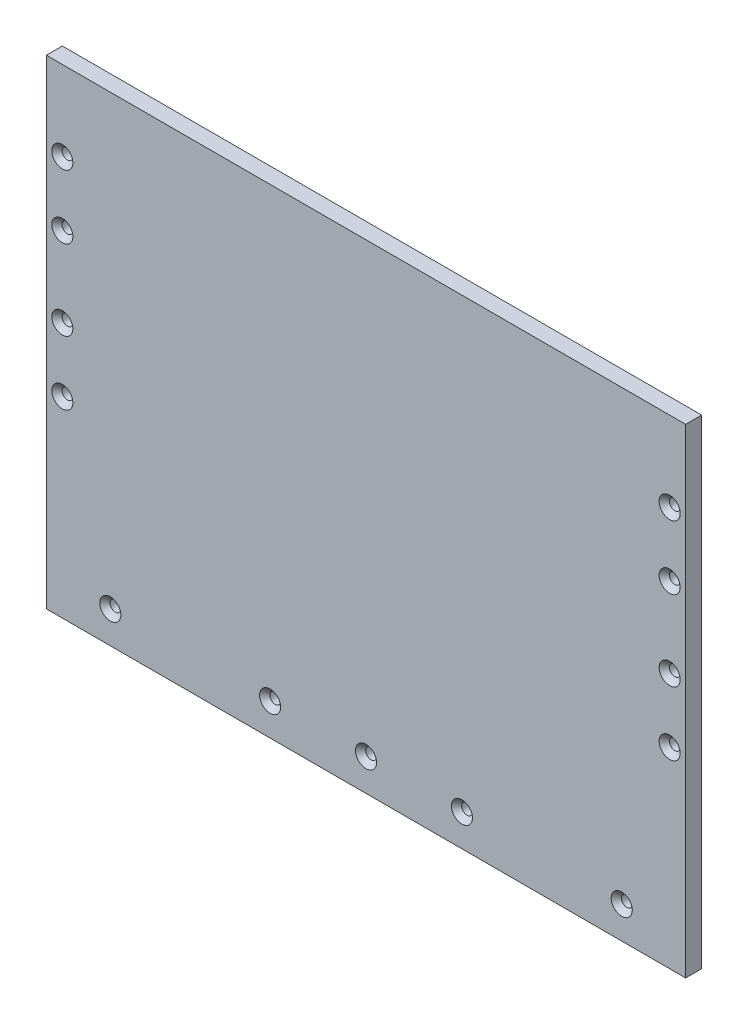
ISO-10303-21;
HEADER;
FILE_DESCRIPTION(('STEP AP214'),'2;1');
FILE_NAME('part.step','',(''),(''),'','','');
FILE_SCHEMA(('AUTOMOTIVE_DESIGN { 1 0 10303 214 1 1 1 1 }'));
ENDSEC;
DATA;
#1=APPLICATION_CONTEXT('core data for automotive mechanical design processes');
#2=APPLICATION_PROTOCOL_DEFINITION('international standard','automotive_design',2000,#1);
#3=PRODUCT_CONTEXT('',#1,'mechanical');
#4=PRODUCT('Part','Part','',(#3));
#5=PRODUCT_RELATED_PRODUCT_CATEGORY('part','',(#4));
#6=PRODUCT_DEFINITION_FORMATION('','',#4);
#7=PRODUCT_DEFINITION_CONTEXT('part definition',#1,'design');
#8=PRODUCT_DEFINITION('design','',#6,#7);
#9=PRODUCT_DEFINITION_SHAPE('','',#8);
#10=(LENGTH_UNIT() NAMED_UNIT(*) SI_UNIT(.MILLI.,.METRE.));
#11=(NAMED_UNIT(*) PLANE_ANGLE_UNIT() SI_UNIT($,.RADIAN.));
#12=(NAMED_UNIT(*) SI_UNIT($,.STERADIAN.) SOLID_ANGLE_UNIT());
#13=UNCERTAINTY_MEASURE_WITH_UNIT(LENGTH_MEASURE(1.E-05),#10,'distance_accuracy_value','');
#14=(GEOMETRIC_REPRESENTATION_CONTEXT(3) GLOBAL_UNCERTAINTY_ASSIGNED_CONTEXT((#13)) GLOBAL_UNIT_ASSIGNED_CONTEXT((#10,
#11,#12)) REPRESENTATION_CONTEXT('',''));
#15=CARTESIAN_POINT('',(0.,0.,0.));
#16=DIRECTION('',(0.,0.,1.));
#17=DIRECTION('',(1.,0.,0.));
#18=AXIS2_PLACEMENT_3D('',#15,#16,#17);
#19=CARTESIAN_POINT('',(100.,75.,5.));
#20=DIRECTION('',(-1.,0.,0.));
#21=DIRECTION('',(0.,-1.,0.));
#22=AXIS2_PLACEMENT_3D('',#19,#20,#21);
#23=PLANE('',#22);
#24=DIRECTION('',(0.,1.,0.));
#25=VECTOR('',#24,1.);
#26=CARTESIAN_POINT('',(100.,75.,0.));
#27=LINE('',#26,#25);
#28=CARTESIAN_POINT('',(100.,-75.,0.));
#29=VERTEX_POINT('',#28);
#30=CARTESIAN_POINT('',(100.,75.,0.));
#31=VERTEX_POINT('',#30);
#32=EDGE_CURVE('E104',#29,#31,#27,.T.);
#33=ORIENTED_EDGE('',*,*,#32,.T.);
#34=DIRECTION('',(0.,0.,-1.));
#35=VECTOR('',#34,1.);
#36=CARTESIAN_POINT('',(100.,75.,5.));
#37=LINE('',#36,#35);
#38=CARTESIAN_POINT('',(100.,75.,5.));
#39=VERTEX_POINT('',#38);
#40=EDGE_CURVE('E11',#39,#31,#37,.T.);
#41=ORIENTED_EDGE('',*,*,#40,.F.);
#42=DIRECTION('',(0.,1.,0.));
#43=VECTOR('',#42,1.);
#44=CARTESIAN_POINT('',(100.,75.,5.));
#45=LINE('',#44,#43);
#46=CARTESIAN_POINT('',(100.,-75.,5.));
#47=VERTEX_POINT('',#46);
#48=EDGE_CURVE('E91',#47,#39,#45,.T.);
#49=ORIENTED_EDGE('',*,*,#48,.F.);
#50=DIRECTION('',(0.,0.,-1.));
#51=VECTOR('',#50,1.);
#52=CARTESIAN_POINT('',(100.,-75.,5.));
#53=LINE('',#52,#51);
#54=EDGE_CURVE('E100',#47,#29,#53,.T.);
#55=ORIENTED_EDGE('',*,*,#54,.T.);
#56=EDGE_LOOP('',(#33,#41,#49,#55));
#57=FACE_BOUND('',#56,.T.);
#58=ADVANCED_FACE('F38',(#57),#23,.F.);
#59=CARTESIAN_POINT('',(-100.,75.,5.));
#60=DIRECTION('',(0.,-1.,0.));
#61=DIRECTION('',(0.,0.,-1.));
#62=AXIS2_PLACEMENT_3D('',#59,#60,#61);
#63=PLANE('',#62);
#64=DIRECTION('',(-1.,0.,0.));
#65=VECTOR('',#64,1.);
#66=CARTESIAN_POINT('',(-100.,75.,0.));
#67=LINE('',#66,#65);
#68=CARTESIAN_POINT('',(-100.,75.,0.));
#69=VERTEX_POINT('',#68);
#70=EDGE_CURVE('E95',#31,#69,#67,.T.);
#71=ORIENTED_EDGE('',*,*,#70,.T.);
#72=DIRECTION('',(0.,0.,-1.));
#73=VECTOR('',#72,1.);
#74=CARTESIAN_POINT('',(-100.,75.,5.));
#75=LINE('',#74,#73);
#76=CARTESIAN_POINT('',(-100.,75.,5.));
#77=VERTEX_POINT('',#76);
#78=EDGE_CURVE('E47',#77,#69,#75,.T.);
#79=ORIENTED_EDGE('',*,*,#78,.F.);
#80=DIRECTION('',(-1.,0.,0.));
#81=VECTOR('',#80,1.);
#82=CARTESIAN_POINT('',(-100.,75.,5.));
#83=LINE('',#82,#81);
#84=EDGE_CURVE('E86',#39,#77,#83,.T.);
#85=ORIENTED_EDGE('',*,*,#84,.F.);
#86=ORIENTED_EDGE('',*,*,#40,.T.);
#87=EDGE_LOOP('',(#71,#79,#85,#86));
#88=FACE_BOUND('',#87,.T.);
#89=ADVANCED_FACE('F94',(#88),#63,.F.);
#90=CARTESIAN_POINT('',(-100.,75.,5.));
#91=DIRECTION('',(1.,0.,0.));
#92=DIRECTION('',(0.,1.,0.));
#93=AXIS2_PLACEMENT_3D('',#90,#91,#92);
#94=PLANE('',#93);
#95=DIRECTION('',(0.,-1.,0.));
#96=VECTOR('',#95,1.);
#97=CARTESIAN_POINT('',(-100.,75.,0.));
#98=LINE('',#97,#96);
#99=CARTESIAN_POINT('',(-100.,-75.,0.));
#100=VERTEX_POINT('',#99);
#101=EDGE_CURVE('E73',#69,#100,#98,.T.);
#102=ORIENTED_EDGE('',*,*,#101,.T.);
#103=DIRECTION('',(0.,0.,-1.));
#104=VECTOR('',#103,1.);
#105=CARTESIAN_POINT('',(-100.,-75.,5.));
#106=LINE('',#105,#104);
#107=CARTESIAN_POINT('',(-100.,-75.,5.));
#108=VERTEX_POINT('',#107);
#109=EDGE_CURVE('E96',#108,#100,#106,.T.);
#110=ORIENTED_EDGE('',*,*,#109,.F.);
#111=DIRECTION('',(0.,-1.,0.));
#112=VECTOR('',#111,1.);
#113=CARTESIAN_POINT('',(-100.,75.,5.));
#114=LINE('',#113,#112);
#115=EDGE_CURVE('E89',#77,#108,#114,.T.);
#116=ORIENTED_EDGE('',*,*,#115,.F.);
#117=ORIENTED_EDGE('',*,*,#78,.T.);
#118=EDGE_LOOP('',(#102,#110,#116,#117));
#119=FACE_BOUND('',#118,.T.);
#120=ADVANCED_FACE('F98',(#119),#94,.F.);
#121=CARTESIAN_POINT('',(-100.,-75.,5.));
#122=DIRECTION('',(0.,1.,0.));
#123=DIRECTION('',(0.,0.,1.));
#124=AXIS2_PLACEMENT_3D('',#121,#122,#123);
#125=PLANE('',#124);
#126=DIRECTION('',(1.,0.,0.));
#127=VECTOR('',#126,1.);
#128=CARTESIAN_POINT('',(-100.,-75.,0.));
#129=LINE('',#128,#127);
#130=EDGE_CURVE('E79',#100,#29,#129,.T.);
#131=ORIENTED_EDGE('',*,*,#130,.T.);
#132=ORIENTED_EDGE('',*,*,#54,.F.);
#133=DIRECTION('',(1.,0.,0.));
#134=VECTOR('',#133,1.);
#135=CARTESIAN_POINT('',(-100.,-75.,5.));
#136=LINE('',#135,#134);
#137=EDGE_CURVE('E56',#108,#47,#136,.T.);
#138=ORIENTED_EDGE('',*,*,#137,.F.);
#139=ORIENTED_EDGE('',*,*,#109,.T.);
#140=EDGE_LOOP('',(#131,#132,#138,#139));
#141=FACE_BOUND('',#140,.T.);
#142=ADVANCED_FACE('F237',(#141),#125,.F.);
#143=CARTESIAN_POINT('',(0.,0.,5.));
#144=DIRECTION('',(0.,0.,1.));
#145=DIRECTION('',(1.,0.,0.));
#146=AXIS2_PLACEMENT_3D('',#143,#144,#145);
#147=PLANE('',#146);
#148=CARTESIAN_POINT('',(-95.,50.,5.));
#149=DIRECTION('',(0.,0.,1.));
#150=DIRECTION('',(1.,0.,0.));
#151=AXIS2_PLACEMENT_3D('',#148,#149,#150);
#152=CIRCLE('',#151,3.3);
#153=CARTESIAN_POINT('',(-91.7,50.,5.));
#154=VERTEX_POINT('',#153);
#155=EDGE_CURVE('E611',#154,#154,#152,.T.);
#156=ORIENTED_EDGE('',*,*,#155,.F.);
#157=EDGE_LOOP('',(#156));
#158=FACE_BOUND('',#157,.T.);
#159=CARTESIAN_POINT('',(-95.,30.,5.));
#160=DIRECTION('',(0.,0.,1.));
#161=DIRECTION('',(1.,0.,0.));
#162=AXIS2_PLACEMENT_3D('',#159,#160,#161);
#163=CIRCLE('',#162,3.3);
#164=CARTESIAN_POINT('',(-91.7,30.,5.));
#165=VERTEX_POINT('',#164);
#166=EDGE_CURVE('E174',#165,#165,#163,.T.);
#167=ORIENTED_EDGE('',*,*,#166,.F.);
#168=EDGE_LOOP('',(#167));
#169=FACE_BOUND('',#168,.T.);
#170=CARTESIAN_POINT('',(-95.,5.00000000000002,5.));
#171=DIRECTION('',(0.,0.,1.));
#172=DIRECTION('',(1.,0.,0.));
#173=AXIS2_PLACEMENT_3D('',#170,#171,#172);
#174=CIRCLE('',#173,3.3);
#175=CARTESIAN_POINT('',(-91.7,5.00000000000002,5.));
#176=VERTEX_POINT('',#175);
#177=EDGE_CURVE('E167',#176,#176,#174,.T.);
#178=ORIENTED_EDGE('',*,*,#177,.F.);
#179=EDGE_LOOP('',(#178));
#180=FACE_BOUND('',#179,.T.);
#181=CARTESIAN_POINT('',(-95.,-15.,5.));
#182=DIRECTION('',(0.,0.,1.));
#183=DIRECTION('',(1.,0.,0.));
#184=AXIS2_PLACEMENT_3D('',#181,#182,#183);
#185=CIRCLE('',#184,3.3);
#186=CARTESIAN_POINT('',(-91.7,-15.,5.));
#187=VERTEX_POINT('',#186);
#188=EDGE_CURVE('E163',#187,#187,#185,.T.);
#189=ORIENTED_EDGE('',*,*,#188,.F.);
#190=EDGE_LOOP('',(#189));
#191=FACE_BOUND('',#190,.T.);
#192=CARTESIAN_POINT('',(-80.,-65.,5.));
#193=DIRECTION('',(0.,0.,1.));
#194=DIRECTION('',(1.,0.,0.));
#195=AXIS2_PLACEMENT_3D('',#192,#193,#194);
#196=CIRCLE('',#195,3.3);
#197=CARTESIAN_POINT('',(-76.7,-65.,5.));
#198=VERTEX_POINT('',#197);
#199=EDGE_CURVE('E159',#198,#198,#196,.T.);
#200=ORIENTED_EDGE('',*,*,#199,.F.);
#201=EDGE_LOOP('',(#200));
#202=FACE_BOUND('',#201,.T.);
#203=CARTESIAN_POINT('',(95.,50.,5.));
#204=DIRECTION('',(0.,0.,1.));
#205=DIRECTION('',(1.,0.,0.));
#206=AXIS2_PLACEMENT_3D('',#203,#204,#205);
#207=CIRCLE('',#206,3.3);
#208=CARTESIAN_POINT('',(98.3,50.,5.));
#209=VERTEX_POINT('',#208);
#210=EDGE_CURVE('E154',#209,#209,#207,.T.);
#211=ORIENTED_EDGE('',*,*,#210,.F.);
#212=EDGE_LOOP('',(#211));
#213=FACE_BOUND('',#212,.T.);
#214=CARTESIAN_POINT('',(95.,30.,5.));
#215=DIRECTION('',(0.,0.,1.));
#216=DIRECTION('',(1.,0.,0.));
#217=AXIS2_PLACEMENT_3D('',#214,#215,#216);
#218=CIRCLE('',#217,3.3);
#219=CARTESIAN_POINT('',(98.3,30.,5.));
#220=VERTEX_POINT('',#219);
#221=EDGE_CURVE('E149',#220,#220,#218,.T.);
#222=ORIENTED_EDGE('',*,*,#221,.F.);
#223=EDGE_LOOP('',(#222));
#224=FACE_BOUND('',#223,.T.);
#225=CARTESIAN_POINT('',(95.,5.00000000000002,5.));
#226=DIRECTION('',(0.,0.,1.));
#227=DIRECTION('',(1.,0.,0.));
#228=AXIS2_PLACEMENT_3D('',#225,#226,#227);
#229=CIRCLE('',#228,3.3);
#230=CARTESIAN_POINT('',(98.3,5.00000000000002,5.));
#231=VERTEX_POINT('',#230);
#232=EDGE_CURVE('E144',#231,#231,#229,.T.);
#233=ORIENTED_EDGE('',*,*,#232,.F.);
#234=EDGE_LOOP('',(#233));
#235=FACE_BOUND('',#234,.T.);
#236=CARTESIAN_POINT('',(95.,-15.,5.));
#237=DIRECTION('',(0.,0.,1.));
#238=DIRECTION('',(1.,0.,0.));
#239=AXIS2_PLACEMENT_3D('',#236,#237,#238);
#240=CIRCLE('',#239,3.3);
#241=CARTESIAN_POINT('',(98.3,-15.,5.));
#242=VERTEX_POINT('',#241);
#243=EDGE_CURVE('E139',#242,#242,#240,.T.);
#244=ORIENTED_EDGE('',*,*,#243,.F.);
#245=EDGE_LOOP('',(#244));
#246=FACE_BOUND('',#245,.T.);
#247=CARTESIAN_POINT('',(80.,-65.,5.));
#248=DIRECTION('',(0.,0.,1.));
#249=DIRECTION('',(1.,0.,0.));
#250=AXIS2_PLACEMENT_3D('',#247,#248,#249);
#251=CIRCLE('',#250,3.3);
#252=CARTESIAN_POINT('',(83.3,-65.,5.));
#253=VERTEX_POINT('',#252);
#254=EDGE_CURVE('E134',#253,#253,#251,.T.);
#255=ORIENTED_EDGE('',*,*,#254,.F.);
#256=EDGE_LOOP('',(#255));
#257=FACE_BOUND('',#256,.T.);
#258=CARTESIAN_POINT('',(-30.,-65.,5.));
#259=DIRECTION('',(0.,0.,1.));
#260=DIRECTION('',(1.,0.,0.));
#261=AXIS2_PLACEMENT_3D('',#258,#259,#260);
#262=CIRCLE('',#261,3.3);
#263=CARTESIAN_POINT('',(-26.7,-65.,5.));
#264=VERTEX_POINT('',#263);
#265=EDGE_CURVE('E129',#264,#264,#262,.T.);
#266=ORIENTED_EDGE('',*,*,#265,.F.);
#267=EDGE_LOOP('',(#266));
#268=FACE_BOUND('',#267,.T.);
#269=CARTESIAN_POINT('',(0.,-65.,5.));
#270=DIRECTION('',(0.,0.,1.));
#271=DIRECTION('',(1.,0.,0.));
#272=AXIS2_PLACEMENT_3D('',#269,#270,#271);
#273=CIRCLE('',#272,3.3);
#274=CARTESIAN_POINT('',(3.29999999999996,-65.,5.));
#275=VERTEX_POINT('',#274);
#276=EDGE_CURVE('E124',#275,#275,#273,.T.);
#277=ORIENTED_EDGE('',*,*,#276,.F.);
#278=EDGE_LOOP('',(#277));
#279=FACE_BOUND('',#278,.T.);
#280=CARTESIAN_POINT('',(30.,-65.,5.));
#281=DIRECTION('',(0.,0.,1.));
#282=DIRECTION('',(1.,0.,0.));
#283=AXIS2_PLACEMENT_3D('',#280,#281,#282);
#284=CIRCLE('',#283,3.3);
#285=CARTESIAN_POINT('',(33.3,-65.,5.));
#286=VERTEX_POINT('',#285);
#287=EDGE_CURVE('E119',#286,#286,#284,.T.);
#288=ORIENTED_EDGE('',*,*,#287,.F.);
#289=EDGE_LOOP('',(#288));
#290=FACE_BOUND('',#289,.T.);
#291=ORIENTED_EDGE('',*,*,#48,.T.);
#292=ORIENTED_EDGE('',*,*,#84,.T.);
#293=ORIENTED_EDGE('',*,*,#115,.T.);
#294=ORIENTED_EDGE('',*,*,#137,.T.);
#295=EDGE_LOOP('',(#291,#292,#293,#294));
#296=FACE_BOUND('',#295,.T.);
#297=ADVANCED_FACE('F87',(#158,#169,#180,#191,#202,#213,#224,#235,#246,#257,#268,#279,#290,
#296),#147,.T.);
#298=CARTESIAN_POINT('',(0.,0.,0.));
#299=DIRECTION('',(0.,0.,1.));
#300=DIRECTION('',(1.,0.,0.));
#301=AXIS2_PLACEMENT_3D('',#298,#299,#300);
#302=PLANE('',#301);
#303=CARTESIAN_POINT('',(-95.,50.,0.));
#304=DIRECTION('',(0.,0.,1.));
#305=DIRECTION('',(1.,0.,0.));
#306=AXIS2_PLACEMENT_3D('',#303,#304,#305);
#307=CIRCLE('',#306,1.69999999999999);
#308=CARTESIAN_POINT('',(-93.3000000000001,50.,0.));
#309=VERTEX_POINT('',#308);
#310=EDGE_CURVE('E41',#309,#309,#307,.T.);
#311=ORIENTED_EDGE('',*,*,#310,.T.);
#312=EDGE_LOOP('',(#311));
#313=FACE_BOUND('',#312,.T.);
#314=CARTESIAN_POINT('',(-95.,30.,0.));
#315=DIRECTION('',(0.,0.,1.));
#316=DIRECTION('',(1.,0.,0.));
#317=AXIS2_PLACEMENT_3D('',#314,#315,#316);
#318=CIRCLE('',#317,1.69999999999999);
#319=CARTESIAN_POINT('',(-93.3000000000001,30.,0.));
#320=VERTEX_POINT('',#319);
#321=EDGE_CURVE('E165',#320,#320,#318,.T.);
#322=ORIENTED_EDGE('',*,*,#321,.T.);
#323=EDGE_LOOP('',(#322));
#324=FACE_BOUND('',#323,.T.);
#325=CARTESIAN_POINT('',(-95.,5.00000000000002,0.));
#326=DIRECTION('',(0.,0.,1.));
#327=DIRECTION('',(1.,0.,0.));
#328=AXIS2_PLACEMENT_3D('',#325,#326,#327);
#329=CIRCLE('',#328,1.69999999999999);
#330=CARTESIAN_POINT('',(-93.3000000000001,5.00000000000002,0.));
#331=VERTEX_POINT('',#330);
#332=EDGE_CURVE('E161',#331,#331,#329,.T.);
#333=ORIENTED_EDGE('',*,*,#332,.T.);
#334=EDGE_LOOP('',(#333));
#335=FACE_BOUND('',#334,.T.);
#336=CARTESIAN_POINT('',(-95.,-15.,0.));
#337=DIRECTION('',(0.,0.,1.));
#338=DIRECTION('',(1.,0.,0.));
#339=AXIS2_PLACEMENT_3D('',#336,#337,#338);
#340=CIRCLE('',#339,1.69999999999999);
#341=CARTESIAN_POINT('',(-93.3000000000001,-15.,0.));
#342=VERTEX_POINT('',#341);
#343=EDGE_CURVE('E156',#342,#342,#340,.T.);
#344=ORIENTED_EDGE('',*,*,#343,.T.);
#345=EDGE_LOOP('',(#344));
#346=FACE_BOUND('',#345,.T.);
#347=CARTESIAN_POINT('',(-80.,-65.,0.));
#348=DIRECTION('',(0.,0.,1.));
#349=DIRECTION('',(1.,0.,0.));
#350=AXIS2_PLACEMENT_3D('',#347,#348,#349);
#351=CIRCLE('',#350,1.69999999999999);
#352=CARTESIAN_POINT('',(-78.3000000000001,-65.,0.));
#353=VERTEX_POINT('',#352);
#354=EDGE_CURVE('E151',#353,#353,#351,.T.);
#355=ORIENTED_EDGE('',*,*,#354,.T.);
#356=EDGE_LOOP('',(#355));
#357=FACE_BOUND('',#356,.T.);
#358=CARTESIAN_POINT('',(95.,50.,0.));
#359=DIRECTION('',(0.,0.,1.));
#360=DIRECTION('',(1.,0.,0.));
#361=AXIS2_PLACEMENT_3D('',#358,#359,#360);
#362=CIRCLE('',#361,1.69999999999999);
#363=CARTESIAN_POINT('',(96.7,50.,0.));
#364=VERTEX_POINT('',#363);
#365=EDGE_CURVE('E146',#364,#364,#362,.T.);
#366=ORIENTED_EDGE('',*,*,#365,.T.);
#367=EDGE_LOOP('',(#366));
#368=FACE_BOUND('',#367,.T.);
#369=CARTESIAN_POINT('',(95.,30.,0.));
#370=DIRECTION('',(0.,0.,1.));
#371=DIRECTION('',(1.,0.,0.));
#372=AXIS2_PLACEMENT_3D('',#369,#370,#371);
#373=CIRCLE('',#372,1.69999999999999);
#374=CARTESIAN_POINT('',(96.7,30.,0.));
#375=VERTEX_POINT('',#374);
#376=EDGE_CURVE('E141',#375,#375,#373,.T.);
#377=ORIENTED_EDGE('',*,*,#376,.T.);
#378=EDGE_LOOP('',(#377));
#379=FACE_BOUND('',#378,.T.);
#380=CARTESIAN_POINT('',(95.,5.00000000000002,0.));
#381=DIRECTION('',(0.,0.,1.));
#382=DIRECTION('',(1.,0.,0.));
#383=AXIS2_PLACEMENT_3D('',#380,#381,#382);
#384=CIRCLE('',#383,1.69999999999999);
#385=CARTESIAN_POINT('',(96.7,5.00000000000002,0.));
#386=VERTEX_POINT('',#385);
#387=EDGE_CURVE('E136',#386,#386,#384,.T.);
#388=ORIENTED_EDGE('',*,*,#387,.T.);
#389=EDGE_LOOP('',(#388));
#390=FACE_BOUND('',#389,.T.);
#391=CARTESIAN_POINT('',(95.,-15.,0.));
#392=DIRECTION('',(0.,0.,1.));
#393=DIRECTION('',(1.,0.,0.));
#394=AXIS2_PLACEMENT_3D('',#391,#392,#393);
#395=CIRCLE('',#394,1.69999999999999);
#396=CARTESIAN_POINT('',(96.7,-15.,0.));
#397=VERTEX_POINT('',#396);
#398=EDGE_CURVE('E131',#397,#397,#395,.T.);
#399=ORIENTED_EDGE('',*,*,#398,.T.);
#400=EDGE_LOOP('',(#399));
#401=FACE_BOUND('',#400,.T.);
#402=CARTESIAN_POINT('',(80.,-65.,0.));
#403=DIRECTION('',(0.,0.,1.));
#404=DIRECTION('',(1.,0.,0.));
#405=AXIS2_PLACEMENT_3D('',#402,#403,#404);
#406=CIRCLE('',#405,1.69999999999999);
#407=CARTESIAN_POINT('',(81.7,-65.,0.));
#408=VERTEX_POINT('',#407);
#409=EDGE_CURVE('E126',#408,#408,#406,.T.);
#410=ORIENTED_EDGE('',*,*,#409,.T.);
#411=EDGE_LOOP('',(#410));
#412=FACE_BOUND('',#411,.T.);
#413=CARTESIAN_POINT('',(-30.,-65.,0.));
#414=DIRECTION('',(0.,0.,1.));
#415=DIRECTION('',(1.,0.,0.));
#416=AXIS2_PLACEMENT_3D('',#413,#414,#415);
#417=CIRCLE('',#416,1.69999999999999);
#418=CARTESIAN_POINT('',(-28.3000000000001,-65.,0.));
#419=VERTEX_POINT('',#418);
#420=EDGE_CURVE('E121',#419,#419,#417,.T.);
#421=ORIENTED_EDGE('',*,*,#420,.T.);
#422=EDGE_LOOP('',(#421));
#423=FACE_BOUND('',#422,.T.);
#424=CARTESIAN_POINT('',(0.,-65.,0.));
#425=DIRECTION('',(0.,0.,1.));
#426=DIRECTION('',(1.,0.,0.));
#427=AXIS2_PLACEMENT_3D('',#424,#425,#426);
#428=CIRCLE('',#427,1.69999999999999);
#429=CARTESIAN_POINT('',(1.69999999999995,-65.,0.));
#430=VERTEX_POINT('',#429);
#431=EDGE_CURVE('E116',#430,#430,#428,.T.);
#432=ORIENTED_EDGE('',*,*,#431,.T.);
#433=EDGE_LOOP('',(#432));
#434=FACE_BOUND('',#433,.T.);
#435=CARTESIAN_POINT('',(30.,-65.,0.));
#436=DIRECTION('',(0.,0.,1.));
#437=DIRECTION('',(1.,0.,0.));
#438=AXIS2_PLACEMENT_3D('',#435,#436,#437);
#439=CIRCLE('',#438,1.69999999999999);
#440=CARTESIAN_POINT('',(31.6999999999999,-65.,0.));
#441=VERTEX_POINT('',#440);
#442=EDGE_CURVE('E107',#441,#441,#439,.T.);
#443=ORIENTED_EDGE('',*,*,#442,.T.);
#444=EDGE_LOOP('',(#443));
#445=FACE_BOUND('',#444,.T.);
#446=ORIENTED_EDGE('',*,*,#32,.F.);
#447=ORIENTED_EDGE('',*,*,#130,.F.);
#448=ORIENTED_EDGE('',*,*,#101,.F.);
#449=ORIENTED_EDGE('',*,*,#70,.F.);
#450=EDGE_LOOP('',(#446,#447,#448,#449));
#451=FACE_BOUND('',#450,.T.);
#452=ADVANCED_FACE('F236',(#313,#324,#335,#346,#357,#368,#379,#390,#401,#412,#423,#434,#445,
#451),#302,.F.);
#453=CARTESIAN_POINT('',(30.,-65.,5.));
#454=DIRECTION('',(0.,0.,1.));
#455=DIRECTION('',(1.,0.,0.));
#456=AXIS2_PLACEMENT_3D('',#453,#454,#455);
#457=CYLINDRICAL_SURFACE('',#456,1.69999999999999);
#458=CARTESIAN_POINT('',(30.,-65.,3.39999999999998));
#459=DIRECTION('',(0.,0.,1.));
#460=DIRECTION('',(1.,0.,0.));
#461=AXIS2_PLACEMENT_3D('',#458,#459,#460);
#462=CIRCLE('',#461,1.69999999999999);
#463=CARTESIAN_POINT('',(31.6999999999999,-65.,3.39999999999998));
#464=VERTEX_POINT('',#463);
#465=EDGE_CURVE('E115',#464,#464,#462,.T.);
#466=ORIENTED_EDGE('',*,*,#465,.T.);
#467=EDGE_LOOP('',(#466));
#468=FACE_BOUND('',#467,.T.);
#469=ORIENTED_EDGE('',*,*,#442,.F.);
#470=EDGE_LOOP('',(#469));
#471=FACE_BOUND('',#470,.T.);
#472=ADVANCED_FACE('F225',(#468,#471),#457,.F.);
#473=CARTESIAN_POINT('',(30.,-65.,5.));
#474=DIRECTION('',(0.,0.,1.));
#475=DIRECTION('',(1.,0.,0.));
#476=AXIS2_PLACEMENT_3D('',#473,#474,#475);
#477=CONICAL_SURFACE('',#476,3.3,0.785398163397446);
#478=ORIENTED_EDGE('',*,*,#465,.F.);
#479=EDGE_LOOP('',(#478));
#480=FACE_BOUND('',#479,.T.);
#481=ORIENTED_EDGE('',*,*,#287,.T.);
#482=EDGE_LOOP('',(#481));
#483=FACE_BOUND('',#482,.T.);
#484=ADVANCED_FACE('F228',(#480,#483),#477,.F.);
#485=CARTESIAN_POINT('',(0.,-65.,5.));
#486=DIRECTION('',(0.,0.,1.));
#487=DIRECTION('',(1.,0.,0.));
#488=AXIS2_PLACEMENT_3D('',#485,#486,#487);
#489=CYLINDRICAL_SURFACE('',#488,1.69999999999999);
#490=CARTESIAN_POINT('',(0.,-65.,3.39999999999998));
#491=DIRECTION('',(0.,0.,1.));
#492=DIRECTION('',(1.,0.,0.));
#493=AXIS2_PLACEMENT_3D('',#490,#491,#492);
#494=CIRCLE('',#493,1.69999999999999);
#495=CARTESIAN_POINT('',(1.69999999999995,-65.,3.39999999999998));
#496=VERTEX_POINT('',#495);
#497=EDGE_CURVE('E120',#496,#496,#494,.T.);
#498=ORIENTED_EDGE('',*,*,#497,.T.);
#499=EDGE_LOOP('',(#498));
#500=FACE_BOUND('',#499,.T.);
#501=ORIENTED_EDGE('',*,*,#431,.F.);
#502=EDGE_LOOP('',(#501));
#503=FACE_BOUND('',#502,.T.);
#504=ADVANCED_FACE('F231',(#500,#503),#489,.F.);
#505=CARTESIAN_POINT('',(0.,-65.,5.));
#506=DIRECTION('',(0.,0.,1.));
#507=DIRECTION('',(1.,0.,0.));
#508=AXIS2_PLACEMENT_3D('',#505,#506,#507);
#509=CONICAL_SURFACE('',#508,3.3,0.785398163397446);
#510=ORIENTED_EDGE('',*,*,#497,.F.);
#511=EDGE_LOOP('',(#510));
#512=FACE_BOUND('',#511,.T.);
#513=ORIENTED_EDGE('',*,*,#276,.T.);
#514=EDGE_LOOP('',(#513));
#515=FACE_BOUND('',#514,.T.);
#516=ADVANCED_FACE('F304',(#512,#515),#509,.F.);
#517=CARTESIAN_POINT('',(-30.,-65.,5.));
#518=DIRECTION('',(0.,0.,1.));
#519=DIRECTION('',(1.,0.,0.));
#520=AXIS2_PLACEMENT_3D('',#517,#518,#519);
#521=CYLINDRICAL_SURFACE('',#520,1.69999999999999);
#522=CARTESIAN_POINT('',(-30.,-65.,3.39999999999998));
#523=DIRECTION('',(0.,0.,1.));
#524=DIRECTION('',(1.,0.,0.));
#525=AXIS2_PLACEMENT_3D('',#522,#523,#524);
#526=CIRCLE('',#525,1.69999999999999);
#527=CARTESIAN_POINT('',(-28.3000000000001,-65.,3.39999999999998));
#528=VERTEX_POINT('',#527);
#529=EDGE_CURVE('E125',#528,#528,#526,.T.);
#530=ORIENTED_EDGE('',*,*,#529,.T.);
#531=EDGE_LOOP('',(#530));
#532=FACE_BOUND('',#531,.T.);
#533=ORIENTED_EDGE('',*,*,#420,.F.);
#534=EDGE_LOOP('',(#533));
#535=FACE_BOUND('',#534,.T.);
#536=ADVANCED_FACE('F315',(#532,#535),#521,.F.);
#537=CARTESIAN_POINT('',(-30.,-65.,5.));
#538=DIRECTION('',(0.,0.,1.));
#539=DIRECTION('',(1.,0.,0.));
#540=AXIS2_PLACEMENT_3D('',#537,#538,#539);
#541=CONICAL_SURFACE('',#540,3.3,0.785398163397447);
#542=ORIENTED_EDGE('',*,*,#529,.F.);
#543=EDGE_LOOP('',(#542));
#544=FACE_BOUND('',#543,.T.);
#545=ORIENTED_EDGE('',*,*,#265,.T.);
#546=EDGE_LOOP('',(#545));
#547=FACE_BOUND('',#546,.T.);
#548=ADVANCED_FACE('F326',(#544,#547),#541,.F.);
#549=CARTESIAN_POINT('',(80.,-65.,5.));
#550=DIRECTION('',(0.,0.,1.));
#551=DIRECTION('',(1.,0.,0.));
#552=AXIS2_PLACEMENT_3D('',#549,#550,#551);
#553=CYLINDRICAL_SURFACE('',#552,1.69999999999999);
#554=CARTESIAN_POINT('',(80.,-65.,3.39999999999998));
#555=DIRECTION('',(0.,0.,1.));
#556=DIRECTION('',(1.,0.,0.));
#557=AXIS2_PLACEMENT_3D('',#554,#555,#556);
#558=CIRCLE('',#557,1.69999999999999);
#559=CARTESIAN_POINT('',(81.7,-65.,3.39999999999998));
#560=VERTEX_POINT('',#559);
#561=EDGE_CURVE('E130',#560,#560,#558,.T.);
#562=ORIENTED_EDGE('',*,*,#561,.T.);
#563=EDGE_LOOP('',(#562));
#564=FACE_BOUND('',#563,.T.);
#565=ORIENTED_EDGE('',*,*,#409,.F.);
#566=EDGE_LOOP('',(#565));
#567=FACE_BOUND('',#566,.T.);
#568=ADVANCED_FACE('F337',(#564,#567),#553,.F.);
#569=CARTESIAN_POINT('',(80.,-65.,5.));
#570=DIRECTION('',(0.,0.,1.));
#571=DIRECTION('',(1.,0.,0.));
#572=AXIS2_PLACEMENT_3D('',#569,#570,#571);
#573=CONICAL_SURFACE('',#572,3.3,0.785398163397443);
#574=ORIENTED_EDGE('',*,*,#561,.F.);
#575=EDGE_LOOP('',(#574));
#576=FACE_BOUND('',#575,.T.);
#577=ORIENTED_EDGE('',*,*,#254,.T.);
#578=EDGE_LOOP('',(#577));
#579=FACE_BOUND('',#578,.T.);
#580=ADVANCED_FACE('F348',(#576,#579),#573,.F.);
#581=CARTESIAN_POINT('',(95.,-15.,5.));
#582=DIRECTION('',(0.,0.,1.));
#583=DIRECTION('',(1.,0.,0.));
#584=AXIS2_PLACEMENT_3D('',#581,#582,#583);
#585=CYLINDRICAL_SURFACE('',#584,1.69999999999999);
#586=CARTESIAN_POINT('',(95.,-15.,3.39999999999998));
#587=DIRECTION('',(0.,0.,1.));
#588=DIRECTION('',(1.,0.,0.));
#589=AXIS2_PLACEMENT_3D('',#586,#587,#588);
#590=CIRCLE('',#589,1.69999999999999);
#591=CARTESIAN_POINT('',(96.7,-15.,3.39999999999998));
#592=VERTEX_POINT('',#591);
#593=EDGE_CURVE('E135',#592,#592,#590,.T.);
#594=ORIENTED_EDGE('',*,*,#593,.T.);
#595=EDGE_LOOP('',(#594));
#596=FACE_BOUND('',#595,.T.);
#597=ORIENTED_EDGE('',*,*,#398,.F.);
#598=EDGE_LOOP('',(#597));
#599=FACE_BOUND('',#598,.T.);
#600=ADVANCED_FACE('F359',(#596,#599),#585,.F.);
#601=CARTESIAN_POINT('',(95.,-15.,5.));
#602=DIRECTION('',(0.,0.,1.));
#603=DIRECTION('',(1.,0.,0.));
#604=AXIS2_PLACEMENT_3D('',#601,#602,#603);
#605=CONICAL_SURFACE('',#604,3.3,0.785398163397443);
#606=ORIENTED_EDGE('',*,*,#593,.F.);
#607=EDGE_LOOP('',(#606));
#608=FACE_BOUND('',#607,.T.);
#609=ORIENTED_EDGE('',*,*,#243,.T.);
#610=EDGE_LOOP('',(#609));
#611=FACE_BOUND('',#610,.T.);
#612=ADVANCED_FACE('F370',(#608,#611),#605,.F.);
#613=CARTESIAN_POINT('',(95.,5.00000000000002,5.));
#614=DIRECTION('',(0.,0.,1.));
#615=DIRECTION('',(1.,0.,0.));
#616=AXIS2_PLACEMENT_3D('',#613,#614,#615);
#617=CYLINDRICAL_SURFACE('',#616,1.69999999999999);
#618=CARTESIAN_POINT('',(95.,5.00000000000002,3.39999999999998));
#619=DIRECTION('',(0.,0.,1.));
#620=DIRECTION('',(1.,0.,0.));
#621=AXIS2_PLACEMENT_3D('',#618,#619,#620);
#622=CIRCLE('',#621,1.69999999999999);
#623=CARTESIAN_POINT('',(96.7,5.00000000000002,3.39999999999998));
#624=VERTEX_POINT('',#623);
#625=EDGE_CURVE('E140',#624,#624,#622,.T.);
#626=ORIENTED_EDGE('',*,*,#625,.T.);
#627=EDGE_LOOP('',(#626));
#628=FACE_BOUND('',#627,.T.);
#629=ORIENTED_EDGE('',*,*,#387,.F.);
#630=EDGE_LOOP('',(#629));
#631=FACE_BOUND('',#630,.T.);
#632=ADVANCED_FACE('F381',(#628,#631),#617,.F.);
#633=CARTESIAN_POINT('',(95.,5.00000000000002,5.));
#634=DIRECTION('',(0.,0.,1.));
#635=DIRECTION('',(1.,0.,0.));
#636=AXIS2_PLACEMENT_3D('',#633,#634,#635);
#637=CONICAL_SURFACE('',#636,3.3,0.785398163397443);
#638=ORIENTED_EDGE('',*,*,#625,.F.);
#639=EDGE_LOOP('',(#638));
#640=FACE_BOUND('',#639,.T.);
#641=ORIENTED_EDGE('',*,*,#232,.T.);
#642=EDGE_LOOP('',(#641));
#643=FACE_BOUND('',#642,.T.);
#644=ADVANCED_FACE('F392',(#640,#643),#637,.F.);
#645=CARTESIAN_POINT('',(95.,30.,5.));
#646=DIRECTION('',(0.,0.,1.));
#647=DIRECTION('',(1.,0.,0.));
#648=AXIS2_PLACEMENT_3D('',#645,#646,#647);
#649=CYLINDRICAL_SURFACE('',#648,1.69999999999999);
#650=CARTESIAN_POINT('',(95.,30.,3.39999999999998));
#651=DIRECTION('',(0.,0.,1.));
#652=DIRECTION('',(1.,0.,0.));
#653=AXIS2_PLACEMENT_3D('',#650,#651,#652);
#654=CIRCLE('',#653,1.69999999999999);
#655=CARTESIAN_POINT('',(96.7,30.,3.39999999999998));
#656=VERTEX_POINT('',#655);
#657=EDGE_CURVE('E145',#656,#656,#654,.T.);
#658=ORIENTED_EDGE('',*,*,#657,.T.);
#659=EDGE_LOOP('',(#658));
#660=FACE_BOUND('',#659,.T.);
#661=ORIENTED_EDGE('',*,*,#376,.F.);
#662=EDGE_LOOP('',(#661));
#663=FACE_BOUND('',#662,.T.);
#664=ADVANCED_FACE('F403',(#660,#663),#649,.F.);
#665=CARTESIAN_POINT('',(95.,30.,5.));
#666=DIRECTION('',(0.,0.,1.));
#667=DIRECTION('',(1.,0.,0.));
#668=AXIS2_PLACEMENT_3D('',#665,#666,#667);
#669=CONICAL_SURFACE('',#668,3.3,0.785398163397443);
#670=ORIENTED_EDGE('',*,*,#657,.F.);
#671=EDGE_LOOP('',(#670));
#672=FACE_BOUND('',#671,.T.);
#673=ORIENTED_EDGE('',*,*,#221,.T.);
#674=EDGE_LOOP('',(#673));
#675=FACE_BOUND('',#674,.T.);
#676=ADVANCED_FACE('F414',(#672,#675),#669,.F.);
#677=CARTESIAN_POINT('',(95.,50.,5.));
#678=DIRECTION('',(0.,0.,1.));
#679=DIRECTION('',(1.,0.,0.));
#680=AXIS2_PLACEMENT_3D('',#677,#678,#679);
#681=CYLINDRICAL_SURFACE('',#680,1.69999999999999);
#682=CARTESIAN_POINT('',(95.,50.,3.39999999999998));
#683=DIRECTION('',(0.,0.,1.));
#684=DIRECTION('',(1.,0.,0.));
#685=AXIS2_PLACEMENT_3D('',#682,#683,#684);
#686=CIRCLE('',#685,1.69999999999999);
#687=CARTESIAN_POINT('',(96.7,50.,3.39999999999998));
#688=VERTEX_POINT('',#687);
#689=EDGE_CURVE('E150',#688,#688,#686,.T.);
#690=ORIENTED_EDGE('',*,*,#689,.T.);
#691=EDGE_LOOP('',(#690));
#692=FACE_BOUND('',#691,.T.);
#693=ORIENTED_EDGE('',*,*,#365,.F.);
#694=EDGE_LOOP('',(#693));
#695=FACE_BOUND('',#694,.T.);
#696=ADVANCED_FACE('F425',(#692,#695),#681,.F.);
#697=CARTESIAN_POINT('',(95.,50.,5.));
#698=DIRECTION('',(0.,0.,1.));
#699=DIRECTION('',(1.,0.,0.));
#700=AXIS2_PLACEMENT_3D('',#697,#698,#699);
#701=CONICAL_SURFACE('',#700,3.3,0.785398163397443);
#702=ORIENTED_EDGE('',*,*,#689,.F.);
#703=EDGE_LOOP('',(#702));
#704=FACE_BOUND('',#703,.T.);
#705=ORIENTED_EDGE('',*,*,#210,.T.);
#706=EDGE_LOOP('',(#705));
#707=FACE_BOUND('',#706,.T.);
#708=ADVANCED_FACE('F436',(#704,#707),#701,.F.);
#709=CARTESIAN_POINT('',(-80.,-65.,5.));
#710=DIRECTION('',(0.,0.,1.));
#711=DIRECTION('',(1.,0.,0.));
#712=AXIS2_PLACEMENT_3D('',#709,#710,#711);
#713=CYLINDRICAL_SURFACE('',#712,1.69999999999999);
#714=CARTESIAN_POINT('',(-80.,-65.,3.39999999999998));
#715=DIRECTION('',(0.,0.,1.));
#716=DIRECTION('',(1.,0.,0.));
#717=AXIS2_PLACEMENT_3D('',#714,#715,#716);
#718=CIRCLE('',#717,1.69999999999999);
#719=CARTESIAN_POINT('',(-78.3000000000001,-65.,3.39999999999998));
#720=VERTEX_POINT('',#719);
#721=EDGE_CURVE('E155',#720,#720,#718,.T.);
#722=ORIENTED_EDGE('',*,*,#721,.T.);
#723=EDGE_LOOP('',(#722));
#724=FACE_BOUND('',#723,.T.);
#725=ORIENTED_EDGE('',*,*,#354,.F.);
#726=EDGE_LOOP('',(#725));
#727=FACE_BOUND('',#726,.T.);
#728=ADVANCED_FACE('F447',(#724,#727),#713,.F.);
#729=CARTESIAN_POINT('',(-80.,-65.,5.));
#730=DIRECTION('',(0.,0.,1.));
#731=DIRECTION('',(1.,0.,0.));
#732=AXIS2_PLACEMENT_3D('',#729,#730,#731);
#733=CONICAL_SURFACE('',#732,3.3,0.785398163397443);
#734=ORIENTED_EDGE('',*,*,#721,.F.);
#735=EDGE_LOOP('',(#734));
#736=FACE_BOUND('',#735,.T.);
#737=ORIENTED_EDGE('',*,*,#199,.T.);
#738=EDGE_LOOP('',(#737));
#739=FACE_BOUND('',#738,.T.);
#740=ADVANCED_FACE('F458',(#736,#739),#733,.F.);
#741=CARTESIAN_POINT('',(-95.,-15.,5.));
#742=DIRECTION('',(0.,0.,1.));
#743=DIRECTION('',(1.,0.,0.));
#744=AXIS2_PLACEMENT_3D('',#741,#742,#743);
#745=CYLINDRICAL_SURFACE('',#744,1.69999999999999);
#746=CARTESIAN_POINT('',(-95.,-15.,3.39999999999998));
#747=DIRECTION('',(0.,0.,1.));
#748=DIRECTION('',(1.,0.,0.));
#749=AXIS2_PLACEMENT_3D('',#746,#747,#748);
#750=CIRCLE('',#749,1.69999999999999);
#751=CARTESIAN_POINT('',(-93.3000000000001,-15.,3.39999999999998));
#752=VERTEX_POINT('',#751);
#753=EDGE_CURVE('E160',#752,#752,#750,.T.);
#754=ORIENTED_EDGE('',*,*,#753,.T.);
#755=EDGE_LOOP('',(#754));
#756=FACE_BOUND('',#755,.T.);
#757=ORIENTED_EDGE('',*,*,#343,.F.);
#758=EDGE_LOOP('',(#757));
#759=FACE_BOUND('',#758,.T.);
#760=ADVANCED_FACE('F469',(#756,#759),#745,.F.);
#761=CARTESIAN_POINT('',(-95.,-15.,5.));
#762=DIRECTION('',(0.,0.,1.));
#763=DIRECTION('',(1.,0.,0.));
#764=AXIS2_PLACEMENT_3D('',#761,#762,#763);
#765=CONICAL_SURFACE('',#764,3.3,0.785398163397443);
#766=ORIENTED_EDGE('',*,*,#753,.F.);
#767=EDGE_LOOP('',(#766));
#768=FACE_BOUND('',#767,.T.);
#769=ORIENTED_EDGE('',*,*,#188,.T.);
#770=EDGE_LOOP('',(#769));
#771=FACE_BOUND('',#770,.T.);
#772=ADVANCED_FACE('F480',(#768,#771),#765,.F.);
#773=CARTESIAN_POINT('',(-95.,5.00000000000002,5.));
#774=DIRECTION('',(0.,0.,1.));
#775=DIRECTION('',(1.,0.,0.));
#776=AXIS2_PLACEMENT_3D('',#773,#774,#775);
#777=CYLINDRICAL_SURFACE('',#776,1.69999999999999);
#778=CARTESIAN_POINT('',(-95.,5.00000000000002,3.39999999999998));
#779=DIRECTION('',(0.,0.,1.));
#780=DIRECTION('',(1.,0.,0.));
#781=AXIS2_PLACEMENT_3D('',#778,#779,#780);
#782=CIRCLE('',#781,1.69999999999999);
#783=CARTESIAN_POINT('',(-93.3000000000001,5.00000000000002,3.39999999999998));
#784=VERTEX_POINT('',#783);
#785=EDGE_CURVE('E164',#784,#784,#782,.T.);
#786=ORIENTED_EDGE('',*,*,#785,.T.);
#787=EDGE_LOOP('',(#786));
#788=FACE_BOUND('',#787,.T.);
#789=ORIENTED_EDGE('',*,*,#332,.F.);
#790=EDGE_LOOP('',(#789));
#791=FACE_BOUND('',#790,.T.);
#792=ADVANCED_FACE('F491',(#788,#791),#777,.F.);
#793=CARTESIAN_POINT('',(-95.,5.00000000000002,5.));
#794=DIRECTION('',(0.,0.,1.));
#795=DIRECTION('',(1.,0.,0.));
#796=AXIS2_PLACEMENT_3D('',#793,#794,#795);
#797=CONICAL_SURFACE('',#796,3.3,0.785398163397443);
#798=ORIENTED_EDGE('',*,*,#785,.F.);
#799=EDGE_LOOP('',(#798));
#800=FACE_BOUND('',#799,.T.);
#801=ORIENTED_EDGE('',*,*,#177,.T.);
#802=EDGE_LOOP('',(#801));
#803=FACE_BOUND('',#802,.T.);
#804=ADVANCED_FACE('F502',(#800,#803),#797,.F.);
#805=CARTESIAN_POINT('',(-95.,30.,5.));
#806=DIRECTION('',(0.,0.,1.));
#807=DIRECTION('',(1.,0.,0.));
#808=AXIS2_PLACEMENT_3D('',#805,#806,#807);
#809=CYLINDRICAL_SURFACE('',#808,1.69999999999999);
#810=CARTESIAN_POINT('',(-95.,30.,3.39999999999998));
#811=DIRECTION('',(0.,0.,1.));
#812=DIRECTION('',(1.,0.,0.));
#813=AXIS2_PLACEMENT_3D('',#810,#811,#812);
#814=CIRCLE('',#813,1.69999999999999);
#815=CARTESIAN_POINT('',(-93.3000000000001,30.,3.39999999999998));
#816=VERTEX_POINT('',#815);
#817=EDGE_CURVE('E168',#816,#816,#814,.T.);
#818=ORIENTED_EDGE('',*,*,#817,.T.);
#819=EDGE_LOOP('',(#818));
#820=FACE_BOUND('',#819,.T.);
#821=ORIENTED_EDGE('',*,*,#321,.F.);
#822=EDGE_LOOP('',(#821));
#823=FACE_BOUND('',#822,.T.);
#824=ADVANCED_FACE('F513',(#820,#823),#809,.F.);
#825=CARTESIAN_POINT('',(-95.,30.,5.));
#826=DIRECTION('',(0.,0.,1.));
#827=DIRECTION('',(1.,0.,0.));
#828=AXIS2_PLACEMENT_3D('',#825,#826,#827);
#829=CONICAL_SURFACE('',#828,3.3,0.785398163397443);
#830=ORIENTED_EDGE('',*,*,#817,.F.);
#831=EDGE_LOOP('',(#830));
#832=FACE_BOUND('',#831,.T.);
#833=ORIENTED_EDGE('',*,*,#166,.T.);
#834=EDGE_LOOP('',(#833));
#835=FACE_BOUND('',#834,.T.);
#836=ADVANCED_FACE('F524',(#832,#835),#829,.F.);
#837=CARTESIAN_POINT('',(-95.,50.,5.));
#838=DIRECTION('',(0.,0.,1.));
#839=DIRECTION('',(1.,0.,0.));
#840=AXIS2_PLACEMENT_3D('',#837,#838,#839);
#841=CYLINDRICAL_SURFACE('',#840,1.69999999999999);
#842=CARTESIAN_POINT('',(-95.,50.,3.39999999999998));
#843=DIRECTION('',(0.,0.,1.));
#844=DIRECTION('',(1.,0.,0.));
#845=AXIS2_PLACEMENT_3D('',#842,#843,#844);
#846=CIRCLE('',#845,1.69999999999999);
#847=CARTESIAN_POINT('',(-93.3000000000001,50.,3.39999999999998));
#848=VERTEX_POINT('',#847);
#849=EDGE_CURVE('E609',#848,#848,#846,.T.);
#850=ORIENTED_EDGE('',*,*,#849,.T.);
#851=EDGE_LOOP('',(#850));
#852=FACE_BOUND('',#851,.T.);
#853=ORIENTED_EDGE('',*,*,#310,.F.);
#854=EDGE_LOOP('',(#853));
#855=FACE_BOUND('',#854,.T.);
#856=ADVANCED_FACE('F534',(#852,#855),#841,.F.);
#857=CARTESIAN_POINT('',(-95.,50.,5.));
#858=DIRECTION('',(0.,0.,1.));
#859=DIRECTION('',(1.,0.,0.));
#860=AXIS2_PLACEMENT_3D('',#857,#858,#859);
#861=CONICAL_SURFACE('',#860,3.3,0.785398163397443);
#862=ORIENTED_EDGE('',*,*,#849,.F.);
#863=EDGE_LOOP('',(#862));
#864=FACE_BOUND('',#863,.T.);
#865=ORIENTED_EDGE('',*,*,#155,.T.);
#866=EDGE_LOOP('',(#865));
#867=FACE_BOUND('',#866,.T.);
#868=ADVANCED_FACE('F545',(#864,#867),#861,.F.);
#869=CLOSED_SHELL('',(#58,#89,#120,#142,#297,#452,#472,#484,#504,#516,#536,#548,#568,#580,#600,
#612,#632,#644,#664,#676,#696,#708,#728,#740,#760,#772,#792,#804,#824,#836,#856,#868));
#870=MANIFOLD_SOLID_BREP('B2',#869);
#871=ADVANCED_BREP_SHAPE_REPRESENTATION('',(#18,#870),#14);
#872=SHAPE_DEFINITION_REPRESENTATION(#9,#871);
ENDSEC;
END-ISO-10303-21;
